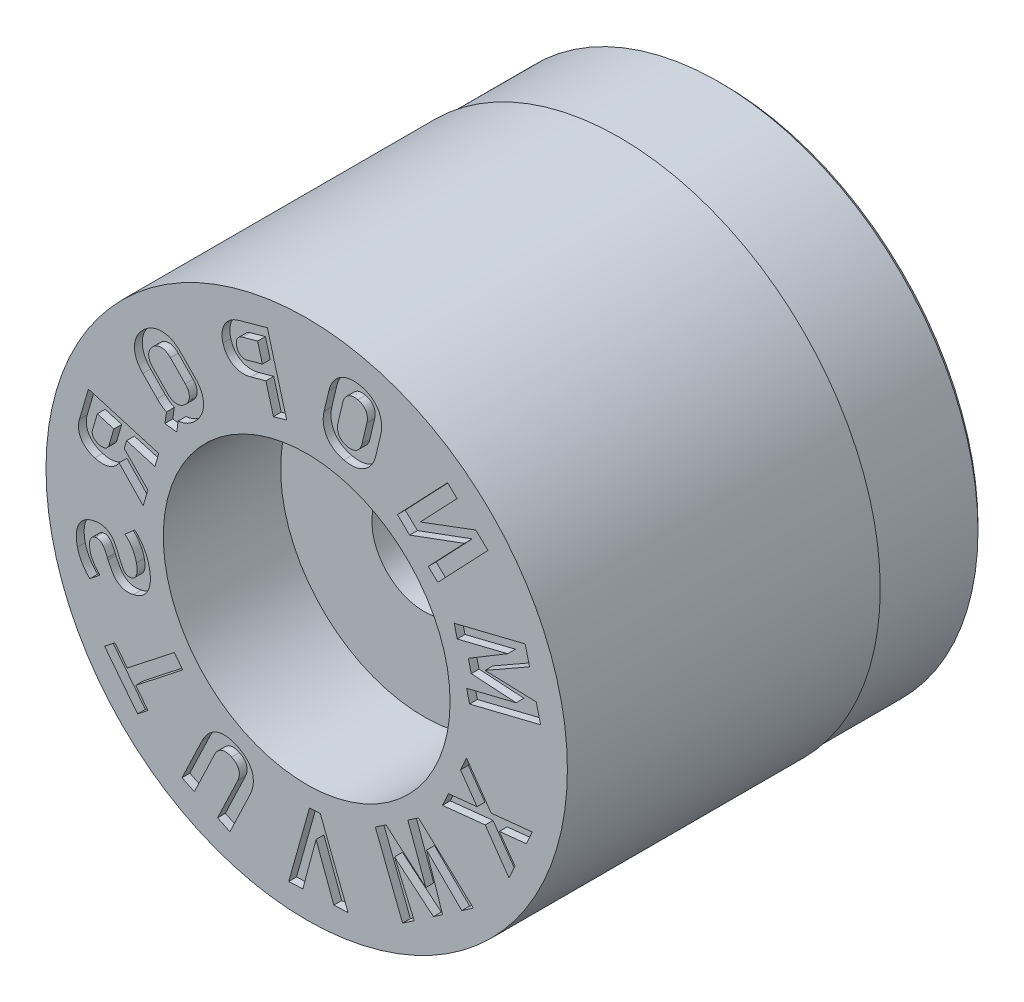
from build123d import *

# Parameters (mm, degrees)
SKETCH4_W          = 4
SKETCH4_H          = 1
CUT_EXTRUDE1_DEPTH = 0.3


with BuildPart() as part:
    # Sketch1 → Revolve1 (revolve)
    with BuildSketch(Plane(origin=(0, 0, 0), x_dir=(0, 0, -1), z_dir=(1, 0, 0)), mode=Mode.PRIVATE) as revolve1_sk:
        Polygon((0, 10), (0, 5.5), (4.5, 5.5), (4.5, 2), (16, 2), (16, 9.75), (15.75, 10), align=None)
    revolve(revolve1_sk.sketch.rotate(Axis((0, 0, 3.797909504), (0, 0, -1)), 90), axis=Axis((0, 0, 3.797909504), (0, 0, -1)))

    # Sketch4 → Cut-Revolve1 (revolve, cut)
    with BuildSketch(Plane(origin=(0, 0, 0), x_dir=(0, 0, -1), z_dir=(1, 0, 0)), mode=Mode.PRIVATE) as cut_revolve1_sk:
        with Locations((14, 10.435)):
            Rectangle(SKETCH4_W, SKETCH4_H)
    revolve(cut_revolve1_sk.sketch.rotate(Axis((0, 0, 0), (0, 0, -1)), 90), axis=Axis((0, 0, 0), (0, 0, -1)), mode=Mode.SUBTRACT)

    # Sketch6 → Cut-Extrude1 (cut)
    # profile 1 of 12: a face of its own
    with BuildSketch(Plane.XY):
        with BuildLine():
            add(Edge.make_bspline(
                [(-2.591195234, 8.623127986), (-2.67044475, 8.600402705), (-2.785185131, 8.557647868), (-2.920440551, 8.472797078), (-3.007776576, 8.399955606), (-3.083752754, 8.318885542), (-3.145008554, 8.228256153), (-3.193731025, 8.130741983), (-3.226912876, 8.025695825), (-3.246772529, 7.915324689), (-3.252473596, 7.758882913), (-3.232792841, 7.640639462), (-3.211239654, 7.562895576)],
                knots=[0, 0, 0, 0, 0.179252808, 0.26350448, 0.345433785, 0.425515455, 0.503835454, 0.58205309, 0.66132605, 0.742114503, 0.824797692, 1, 1, 1, 1], degree=3))
            add(Edge.make_bspline(
                [(-3.211239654, 7.562895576), (-3.189282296, 7.485519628), (-3.147361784, 7.37309945), (-3.061882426, 7.242258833), (-2.98904864, 7.157205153), (-2.90603578, 7.085495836), (-2.815405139, 7.025693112), (-2.715699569, 6.98117484), (-2.609214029, 6.949705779), (-2.496727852, 6.931710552), (-2.337213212, 6.929964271), (-2.216820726, 6.950005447), (-2.137298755, 6.972257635)],
                knots=[0, 0, 0, 0, 0.175255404, 0.258011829, 0.33862957, 0.417861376, 0.495706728, 0.573814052, 0.654275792, 0.736487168, 0.820589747, 1, 1, 1, 1], degree=3))
            Line((-2.137298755, 6.972257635), (-1.564446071, 7.129642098))
            Line((-1.564446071, 7.129642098), (-1.276887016, 6.083230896))
            Line((-1.276887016, 6.083230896), (-0.768489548, 6.223100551))
            Line((-0.768489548, 6.223100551), (-1.509652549, 8.920150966))
            Line((-1.509652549, 8.920150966), (-2.591195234, 8.623127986))
        make_face()
        with BuildLine():
            add(Edge.make_bspline(
                [(-2.284980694, 7.458077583), (-2.313807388, 7.450144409), (-2.357619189, 7.443387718), (-2.415615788, 7.446547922), (-2.456871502, 7.454494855), (-2.496460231, 7.46803516), (-2.533105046, 7.488267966), (-2.567328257, 7.513136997), (-2.598597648, 7.543483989), (-2.626623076, 7.578320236), (-2.659239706, 7.631792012), (-2.676053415, 7.676587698), (-2.684524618, 7.707690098)],
                knots=[0, 0, 0, 0, 0.169501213, 0.248727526, 0.328129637, 0.406936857, 0.484764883, 0.564451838, 0.646040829, 0.730951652, 0.817193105, 1, 1, 1, 1], degree=3))
            add(Edge.make_bspline(
                [(-2.684524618, 7.707690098), (-2.693901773, 7.739260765), (-2.701693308, 7.787033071), (-2.702242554, 7.850356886), (-2.696187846, 7.894778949), (-2.685212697, 7.936888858), (-2.669201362, 7.976086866), (-2.647300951, 8.011810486), (-2.620795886, 8.044201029), (-2.589625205, 8.072930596), (-2.540710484, 8.105531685), (-2.498612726, 8.121481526), (-2.469571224, 8.129768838)],
                knots=[0, 0, 0, 0, 0.184831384, 0.270674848, 0.355195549, 0.436120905, 0.51483931, 0.592349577, 0.670842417, 0.749502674, 0.829832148, 1, 1, 1, 1], degree=3))
            Line((-2.469571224, 8.129768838), (-1.883564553, 8.29089628))
            Line((-1.883564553, 8.29089628), (-1.698979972, 7.619203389))
            Line((-1.698979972, 7.619203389), (-2.284980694, 7.458077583))
        make_face(mode=Mode.SUBTRACT)
    # profile 2 of 12: a face of its own
    with BuildSketch(Plane.XY):
        with BuildLine():
            Line((-4.988295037, 3.71702284), (-4.92936312, 4.112455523))
            add(Edge.make_bspline(
                [(-4.92936312, 4.112455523), (-4.915193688, 4.113560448), (-4.879630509, 4.1172314), (-4.822934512, 4.127400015), (-4.759159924, 4.142119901), (-4.696055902, 4.161588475), (-4.634055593, 4.185879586), (-4.573475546, 4.214864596), (-4.513378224, 4.247465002), (-4.455349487, 4.285641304), (-4.377415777, 4.341591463), (-4.323512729, 4.390578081), (-4.287940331, 4.424416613)],
                knots=[0.553649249, 0.553649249, 0.553649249, 0.553649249, 0.579784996, 0.619379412, 0.659521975, 0.700129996, 0.740745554, 0.781900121, 0.82360875, 0.866408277, 0.909588, 1, 1, 1, 1], degree=3))
            add(Edge.make_bspline(
                [(-4.287940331, 4.424416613), (-4.252411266, 4.458519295), (-4.203348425, 4.51246366), (-4.144893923, 4.588514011), (-4.105417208, 4.64574899), (-4.071126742, 4.704777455), (-4.040591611, 4.764843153), (-4.015439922, 4.826429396), (-3.993704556, 4.888670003), (-3.976440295, 4.951696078), (-3.96508066, 5.015254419), (-3.956661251, 5.078658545), (-3.954221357, 5.142356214), (-3.955950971, 5.20610561), (-3.962435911, 5.269974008), (-3.973462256, 5.33375012), (-3.988983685, 5.397468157), (-4.009094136, 5.460731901), (-4.033713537, 5.523028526), (-4.063431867, 5.584042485), (-4.097115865, 5.644029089), (-4.135472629, 5.702989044), (-4.192510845, 5.781472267), (-4.241993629, 5.83631679), (-4.276283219, 5.872223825)],
                knots=[0, 0, 0, 0, 0.090541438, 0.133852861, 0.176352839, 0.218315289, 0.259314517, 0.30017771, 0.340558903, 0.380521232, 0.420203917, 0.45922422, 0.498060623, 0.537296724, 0.576434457, 0.616019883, 0.656243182, 0.69695486, 0.7380197, 0.779323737, 0.821679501, 0.864469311, 0.908620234, 1, 1, 1, 1], degree=3))
            Line((-4.276283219, 5.872223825), (-4.827791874, 6.437969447))
            add(Edge.make_bspline(
                [(-4.827791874, 6.437969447), (-4.862366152, 6.473558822), (-4.916268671, 6.523627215), (-4.99303839, 6.582969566), (-5.051097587, 6.622289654), (-5.10995445, 6.658041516), (-5.170306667, 6.688592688), (-5.23210631, 6.714658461), (-5.294780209, 6.73681774), (-5.358169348, 6.754613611), (-5.42189329, 6.766622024), (-5.485463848, 6.775622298), (-5.549156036, 6.778649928), (-5.612877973, 6.777387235), (-5.676621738, 6.771746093), (-5.740263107, 6.760334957), (-5.804035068, 6.745609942), (-5.8671492, 6.726159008), (-5.92911147, 6.701802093), (-5.989923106, 6.673025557), (-6.049454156, 6.639466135), (-6.108244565, 6.60228646), (-6.185367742, 6.545162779), (-6.239876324, 6.496838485), (-6.275271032, 6.462746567)],
                knots=[0, 0, 0, 0, 0.091249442, 0.135045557, 0.178318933, 0.22014303, 0.261604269, 0.302590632, 0.343407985, 0.383789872, 0.423525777, 0.462578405, 0.501768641, 0.540634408, 0.579726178, 0.619307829, 0.65943745, 0.700032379, 0.740634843, 0.781776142, 0.82364848, 0.866237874, 0.909617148, 1, 1, 1, 1], degree=3))
            add(Edge.make_bspline(
                [(-6.275271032, 6.462746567), (-6.310462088, 6.428536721), (-6.359978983, 6.375205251), (-6.418494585, 6.299150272), (-6.457444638, 6.241580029), (-6.492256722, 6.182874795), (-6.522576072, 6.122872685), (-6.5477649, 6.061308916), (-6.569490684, 5.999062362), (-6.586756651, 5.936037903), (-6.598118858, 5.872478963), (-6.606551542, 5.808886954), (-6.609009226, 5.745184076), (-6.607169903, 5.681448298), (-6.600956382, 5.617686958), (-6.588967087, 5.554042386), (-6.5736992, 5.490241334), (-6.553517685, 5.426989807), (-6.52891548, 5.364691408), (-6.499200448, 5.30367208), (-6.46548493, 5.243709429), (-6.427335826, 5.184783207), (-6.3697411, 5.106896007), (-6.320753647, 5.051873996), (-6.286329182, 5.016065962)],
                knots=[0, 0, 0, 0, 0.090315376, 0.133647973, 0.176462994, 0.218139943, 0.259159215, 0.300042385, 0.34044332, 0.380425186, 0.420127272, 0.459166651, 0.498371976, 0.537277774, 0.57643464, 0.616108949, 0.656351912, 0.697083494, 0.738168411, 0.77949264, 0.821869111, 0.864679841, 0.908575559, 1, 1, 1, 1], degree=3))
            Line((-6.286329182, 5.016065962), (-5.734820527, 4.450320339))
            add(Edge.make_bspline(
                [(-5.734820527, 4.450320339), (-5.700358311, 4.414592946), (-5.646045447, 4.36485089), (-5.569827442, 4.304903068), (-5.511916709, 4.265119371), (-5.452756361, 4.229858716), (-5.407084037, 4.206606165), (-5.381301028, 4.194931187), (-5.376038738, 4.192604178)],
                knots=[0, 0, 0, 0, 0.09127887, 0.135296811, 0.178290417, 0.220432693, 0.261907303, 0.272490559, 0.272490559, 0.272490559, 0.272490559], degree=3))
            Line((-5.376038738, 4.192604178), (-5.438853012, 3.777376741))
            Line((-5.438853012, 3.777376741), (-4.988295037, 3.71702284))
        make_face()
        with BuildLine():
            Line((-5.227483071, 6.067245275), (-4.657050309, 5.482190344))
            add(Edge.make_bspline(
                [(-4.657050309, 5.482190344), (-4.62442155, 5.44941543), (-4.582934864, 5.395558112), (-4.540001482, 5.317654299), (-4.518235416, 5.258149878), (-4.50473558, 5.197718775), (-4.499901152, 5.137270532), (-4.503506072, 5.077114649), (-4.516876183, 5.017773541), (-4.538017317, 4.959227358), (-4.58060022, 4.883376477), (-4.621817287, 4.831319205), (-4.654685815, 4.800605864)],
                knots=[0, 0, 0, 0, 0.180280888, 0.264139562, 0.346503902, 0.426870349, 0.505307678, 0.582632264, 0.661315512, 0.742137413, 0.824876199, 1, 1, 1, 1], degree=3))
            add(Edge.make_bspline(
                [(-4.654685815, 4.800605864), (-4.686733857, 4.769362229), (-4.738586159, 4.727597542), (-4.81613536, 4.688847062), (-4.874880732, 4.66909576), (-4.934635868, 4.657045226), (-4.995117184, 4.654802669), (-5.055593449, 4.660667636), (-5.115309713, 4.67647403), (-5.174272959, 4.699327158), (-5.251626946, 4.74335129), (-5.303568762, 4.787440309), (-5.335714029, 4.820488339)],
                knots=[0, 0, 0, 0, 0.175162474, 0.257631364, 0.337589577, 0.416766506, 0.494992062, 0.57327058, 0.653335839, 0.735643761, 0.819774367, 1, 1, 1, 1], degree=3))
            Line((-5.335714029, 4.820488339), (-5.906146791, 5.405543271))
            add(Edge.make_bspline(
                [(-5.906146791, 5.405543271), (-5.938656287, 5.438382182), (-5.980587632, 5.492187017), (-6.023038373, 5.570540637), (-6.044881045, 5.62997816), (-6.058466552, 5.690185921), (-6.063500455, 5.750490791), (-6.05888983, 5.810571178), (-6.045940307, 5.869813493), (-6.024458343, 5.927760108), (-5.982857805, 6.003769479), (-5.940356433, 6.054816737), (-5.907969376, 6.085972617)],
                knots=[0, 0, 0, 0, 0.180520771, 0.265137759, 0.347611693, 0.427363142, 0.505904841, 0.583364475, 0.66215242, 0.742377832, 0.824225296, 1, 1, 1, 1], degree=3))
            add(Edge.make_bspline(
                [(-5.907969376, 6.085972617), (-5.876015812, 6.117378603), (-5.823821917, 6.158734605), (-5.746541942, 6.198259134), (-5.687851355, 6.218756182), (-5.628171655, 6.23057853), (-5.567876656, 6.233006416), (-5.507709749, 6.226826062), (-5.447649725, 6.212179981), (-5.389071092, 6.188193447), (-5.311505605, 6.144559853), (-5.259662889, 6.100198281), (-5.227483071, 6.067245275)],
                knots=[0, 0, 0, 0, 0.175168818, 0.257991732, 0.338211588, 0.417391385, 0.494878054, 0.573159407, 0.653065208, 0.735634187, 0.81976784, 1, 1, 1, 1], degree=3))
        make_face(mode=Mode.SUBTRACT)
    # profile 3 of 12: a face of its own
    with BuildSketch(Plane.XY):
        with BuildLine():
            add(Edge.make_bspline(
                [(-8.718530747, 2.272305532), (-8.739406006, 2.20204696), (-8.758667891, 2.094830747), (-8.753785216, 1.952478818), (-8.736079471, 1.851296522), (-8.703413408, 1.755234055), (-8.659088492, 1.664478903), (-8.599926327, 1.581223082), (-8.528264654, 1.505143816), (-8.44534199, 1.43596101), (-8.315526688, 1.355822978), (-8.207258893, 1.311451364), (-8.130967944, 1.289828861)],
                knots=[0, 0, 0, 0, 0.170771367, 0.250982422, 0.330577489, 0.40900235, 0.486464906, 0.564914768, 0.645788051, 0.729220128, 0.815575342, 1, 1, 1, 1], degree=3))
            add(Edge.make_bspline(
                [(-8.130967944, 1.289828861), (-8.055068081, 1.267246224), (-7.940295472, 1.245134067), (-7.787940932, 1.243308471), (-7.680719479, 1.255886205), (-7.579153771, 1.281747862), (-7.484244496, 1.319945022), (-7.397555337, 1.372376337), (-7.318456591, 1.436352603), (-7.250012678, 1.510113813), (-7.21165165, 1.564598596), (-7.194876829, 1.592122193)],
                knots=[0, 0, 0, 0, 0.184423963, 0.270194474, 0.35389435, 0.43505401, 0.513570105, 0.591211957, 0.670062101, 0.749724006, 0.824733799, 0.824733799, 0.824733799, 0.824733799], degree=3))
            Line((-7.194876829, 1.592122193), (-6.272832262, 0.622166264))
            Line((-6.272832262, 0.622166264), (-6.092420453, 1.237829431))
            Line((-6.092420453, 1.237829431), (-6.998405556, 2.163204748))
            Line((-6.998405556, 2.163204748), (-6.907959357, 2.471516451))
            Line((-6.907959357, 2.471516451), (-5.8235573, 2.153299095))
            Line((-5.8235573, 2.153299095), (-5.674607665, 2.66170992))
            Line((-5.674607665, 2.66170992), (-8.372311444, 3.453350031))
            Line((-8.372311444, 3.453350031), (-8.718530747, 2.272305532))
        make_face()
        with BuildLine():
            add(Edge.make_bspline(
                [(-7.582992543, 1.983038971), (-7.589856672, 1.958220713), (-7.605857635, 1.923617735), (-7.63511738, 1.882564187), (-7.662085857, 1.85738881), (-7.691752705, 1.834985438), (-7.725236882, 1.818045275), (-7.761781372, 1.80537099), (-7.801091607, 1.797810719), (-7.842841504, 1.794784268), (-7.902426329, 1.79531085), (-7.947275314, 1.80572021), (-7.977375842, 1.812885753)],
                knots=[0, 0, 0, 0, 0.159908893, 0.23595126, 0.312748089, 0.388947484, 0.467051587, 0.545577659, 0.629446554, 0.715777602, 0.806283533, 1, 1, 1, 1], degree=3))
            add(Edge.make_bspline(
                [(-7.977375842, 1.812885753), (-8.007233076, 1.821450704), (-8.049712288, 1.838351), (-8.101283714, 1.868150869), (-8.134563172, 1.89362108), (-8.163296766, 1.92148516), (-8.187816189, 1.95125262), (-8.206527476, 1.983744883), (-8.219715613, 2.018313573), (-8.228517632, 2.054347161), (-8.230255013, 2.105484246), (-8.225649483, 2.144137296), (-8.217280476, 2.16928771)],
                knots=[0, 0, 0, 0, 0.192684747, 0.282498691, 0.368990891, 0.452129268, 0.530546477, 0.607654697, 0.68370684, 0.759694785, 0.836703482, 1, 1, 1, 1], degree=3))
            Line((-8.217280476, 2.16928771), (-8.031784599, 2.801302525))
            Line((-8.031784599, 2.801302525), (-7.397464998, 2.615161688))
            Line((-7.397464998, 2.615161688), (-7.582992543, 1.983038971))
        make_face(mode=Mode.SUBTRACT)
    # profile 4 of 12: a face of its own
    with BuildSketch(Plane.XY):
        with BuildLine():
            Line((0.85000125, 8.008025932), (0.667250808, 7.236892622))
            add(Edge.make_bspline(
                [(0.667250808, 7.236892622), (0.65523135, 7.18847351), (0.642947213, 7.115440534), (0.633622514, 7.018517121), (0.630459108, 6.948047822), (0.633062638, 6.878900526), (0.639671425, 6.811124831), (0.650507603, 6.744601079), (0.665381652, 6.679673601), (0.685204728, 6.616802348), (0.707768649, 6.55575686), (0.735762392, 6.497895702), (0.766944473, 6.442185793), (0.801709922, 6.388522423), (0.841857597, 6.338288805), (0.884367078, 6.289241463), (0.931956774, 6.244118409), (0.982352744, 6.201169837), (1.036432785, 6.162159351), (1.092965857, 6.125381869), (1.153525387, 6.093851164), (1.216125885, 6.063452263), (1.306026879, 6.029454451), (1.375812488, 6.007852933), (1.423957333, 5.996945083)],
                knots=[0, 0, 0, 0, 0.091392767, 0.135555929, 0.178469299, 0.220603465, 0.262298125, 0.303240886, 0.344092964, 0.384290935, 0.42402646, 0.463295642, 0.501981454, 0.541037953, 0.580347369, 0.619781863, 0.659929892, 0.700442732, 0.741087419, 0.782099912, 0.823957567, 0.86616382, 0.909605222, 1, 1, 1, 1], degree=3))
            add(Edge.make_bspline(
                [(1.423957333, 5.996945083), (1.471844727, 5.985259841), (1.543807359, 5.973136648), (1.639593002, 5.963221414), (1.709324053, 5.961609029), (1.777825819, 5.963183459), (1.844780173, 5.970853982), (1.910658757, 5.98169564), (1.975053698, 5.996936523), (2.037630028, 6.016843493), (2.097859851, 6.04042158), (2.155888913, 6.068154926), (2.211199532, 6.09986054), (2.264102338, 6.135926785), (2.314728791, 6.175450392), (2.362878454, 6.219125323), (2.408673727, 6.266404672), (2.450814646, 6.317914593), (2.490638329, 6.372251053), (2.526727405, 6.430096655), (2.5591937, 6.49120408), (2.588944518, 6.554959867), (2.624045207, 6.645704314), (2.644567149, 6.716747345), (2.655774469, 6.765414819)],
                knots=[0, 0, 0, 0, 0.09029555, 0.133687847, 0.176436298, 0.218102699, 0.259215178, 0.299881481, 0.340471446, 0.380424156, 0.420189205, 0.458974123, 0.498245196, 0.536962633, 0.576277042, 0.61591342, 0.656066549, 0.696844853, 0.737838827, 0.779516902, 0.821728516, 0.864647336, 0.908441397, 1, 1, 1, 1], degree=3))
            Line((2.655774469, 6.765414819), (2.838524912, 7.53654813))
            add(Edge.make_bspline(
                [(2.838524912, 7.53654813), (2.850080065, 7.584987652), (2.863411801, 7.657771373), (2.872868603, 7.75474671), (2.874970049, 7.825223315), (2.873393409, 7.894110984), (2.866819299, 7.961552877), (2.856081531, 8.027832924), (2.840928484, 8.092812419), (2.822007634, 8.15599525), (2.798319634, 8.216735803), (2.771307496, 8.275209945), (2.739289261, 8.33079785), (2.704643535, 8.384485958), (2.664889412, 8.434823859), (2.622399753, 8.483655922), (2.574885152, 8.528873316), (2.524256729, 8.571548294), (2.470926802, 8.611653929), (2.413535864, 8.64709046), (2.353606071, 8.68016248), (2.290140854, 8.709159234), (2.200850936, 8.745219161), (2.130108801, 8.764201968), (2.082327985, 8.77623894)],
                knots=[0, 0, 0, 0, 0.091283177, 0.135446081, 0.178504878, 0.220472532, 0.261685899, 0.302628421, 0.34348026, 0.383929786, 0.423430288, 0.462913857, 0.501889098, 0.540945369, 0.579939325, 0.619373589, 0.659521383, 0.700033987, 0.740736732, 0.781714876, 0.823582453, 0.866147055, 0.909556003, 1, 1, 1, 1], degree=3))
            add(Edge.make_bspline(
                [(2.082327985, 8.77623894), (2.034391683, 8.787043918), (1.962688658, 8.801429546), (1.866991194, 8.809534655), (1.797377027, 8.812259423), (1.729039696, 8.809202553), (1.661661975, 8.803293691), (1.595866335, 8.791469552), (1.531554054, 8.775667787), (1.468786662, 8.756746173), (1.408675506, 8.732107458), (1.350519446, 8.704937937), (1.295426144, 8.672661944), (1.242174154, 8.63745116), (1.191530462, 8.597854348), (1.143778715, 8.55356947), (1.098120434, 8.505982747), (1.055075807, 8.454929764), (1.015558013, 8.400532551), (0.979437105, 8.342942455), (0.947099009, 8.28197414), (0.917344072, 8.218224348), (0.882224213, 8.127523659), (0.861886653, 8.056474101), (0.85000125, 8.008025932)],
                knots=[0, 0, 0, 0, 0.090202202, 0.133729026, 0.176021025, 0.217861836, 0.259087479, 0.299967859, 0.340298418, 0.380508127, 0.420048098, 0.459328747, 0.4981232, 0.537017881, 0.576338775, 0.6158572, 0.656350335, 0.697214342, 0.738215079, 0.779552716, 0.821771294, 0.864697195, 0.90849848, 1, 1, 1, 1], degree=3))
        make_face()
        with BuildLine():
            Line((2.310452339, 7.675436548), (2.121497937, 6.878037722))
            add(Edge.make_bspline(
                [(2.121497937, 6.878037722), (2.111222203, 6.832884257), (2.088740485, 6.768143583), (2.044618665, 6.690472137), (2.006270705, 6.639746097), (1.962669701, 6.595623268), (1.9133517, 6.559933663), (1.860183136, 6.531046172), (1.802715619, 6.509969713), (1.741735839, 6.497326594), (1.654966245, 6.490660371), (1.588980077, 6.500786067), (1.545193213, 6.510270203)],
                knots=[0, 0, 0, 0, 0.180291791, 0.264850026, 0.346935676, 0.427278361, 0.505457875, 0.583130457, 0.662262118, 0.742891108, 0.824953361, 1, 1, 1, 1], degree=3))
            add(Edge.make_bspline(
                [(1.545193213, 6.510270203), (1.501053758, 6.519556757), (1.439026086, 6.543364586), (1.363432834, 6.586383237), (1.315201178, 6.625852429), (1.273480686, 6.670375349), (1.239103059, 6.720186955), (1.211649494, 6.774320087), (1.192539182, 6.833118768), (1.18100795, 6.895435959), (1.176172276, 6.984596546), (1.185444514, 7.052531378), (1.196342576, 7.097490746)],
                knots=[0, 0, 0, 0, 0.175121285, 0.257590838, 0.338018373, 0.417080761, 0.494722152, 0.573173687, 0.652869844, 0.734881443, 0.819587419, 1, 1, 1, 1], degree=3))
            Line((1.196342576, 7.097490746), (1.385296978, 7.894889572))
            add(Edge.make_bspline(
                [(1.385296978, 7.894889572), (1.395576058, 7.940038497), (1.418048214, 8.004792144), (1.46218485, 8.08244349), (1.500493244, 8.133223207), (1.544176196, 8.177091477), (1.592897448, 8.213442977), (1.646132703, 8.242096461), (1.703561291, 8.263225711), (1.764551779, 8.275854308), (1.851317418, 8.282525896), (1.917306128, 8.272396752), (1.961092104, 8.26291382)],
                knots=[0, 0, 0, 0, 0.180352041, 0.264938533, 0.347051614, 0.427421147, 0.505292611, 0.582991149, 0.662149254, 0.742805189, 0.824894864, 1, 1, 1, 1], degree=3))
            add(Edge.make_bspline(
                [(1.961092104, 8.26291382), (2.004850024, 8.252823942), (2.067907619, 8.231035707), (2.142709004, 8.18658858), (2.191169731, 8.147421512), (2.232535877, 8.102732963), (2.267882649, 8.053528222), (2.294316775, 7.998694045), (2.314424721, 7.940018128), (2.325733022, 7.87747), (2.330661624, 7.788346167), (2.321329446, 7.720387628), (2.310452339, 7.675436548)],
                knots=[0, 0, 0, 0, 0.175038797, 0.257499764, 0.337870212, 0.416876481, 0.494111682, 0.572950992, 0.653116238, 0.735069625, 0.819715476, 1, 1, 1, 1], degree=3))
        make_face(mode=Mode.SUBTRACT)
    # profile 5 of 12: a face of its own
    with BuildSketch(Plane.XY):
        Polygon((4.664945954, 4.080625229), (5.030049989, 3.733628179), (6.95354354, 5.755869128), (6.486532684, 6.199515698), (4.3575628, 5.40209621), (5.767090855, 6.883759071), (5.40315486, 7.230242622), (3.479661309, 5.208001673), (3.948494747, 4.762160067), (6.051865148, 5.539102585), align=None)
    # profile 6 of 12: a face of its own
    with BuildSketch(Plane.XY):
        Polygon((8.803601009, 1.648867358), (6.840692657, 1.713201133), (8.547570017, 2.685856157), (8.380351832, 3.362026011), (5.65789449, 2.688947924), (5.773188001, 2.222764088), (7.706533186, 2.700408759), (6.20084341, 1.795359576), (6.312544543, 1.342117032), (8.031249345, 1.2347604), (6.133068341, 0.765803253), (6.248361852, 0.299619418), (8.970819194, 0.972697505), align=None)
    # profile 7 of 12: a face of its own
    with BuildSketch(Plane.XY):
        Polygon((5.436502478, -3.081005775), (5.206882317, -3.586151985), (6.848035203, -3.41569667), (7.759106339, -4.719489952), (7.9887265, -4.214343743), (7.390181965, -3.359510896), (8.425217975, -3.252639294), (8.654838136, -2.747493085), (7.076678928, -2.910992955), (6.129787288, -1.554142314), (5.900167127, -2.059288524), (6.534798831, -2.967151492), align=None)
    # profile 8 of 12: a face of its own
    with BuildSketch(Plane.XY):
        Polygon((4.124924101, -7.957999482), (3.369784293, -6.216681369), (4.862154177, -7.453879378), (5.211381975, -7.215381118), (4.600186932, -5.375301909), (5.948819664, -6.71072951), (6.395942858, -6.405103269), (4.287812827, -4.462416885), (3.879048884, -4.74198255), (4.571298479, -6.633326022), (3.041498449, -5.314733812), (2.632734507, -5.594299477), (3.677800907, -8.263625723), align=None)
    # profile 9 of 12: a face of its own
    with BuildSketch(Plane.XY):
        Polygon((0.52086762, -6.201195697), (0.108305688, -6.220992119), (-0.690613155, -9.065359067), (-0.147382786, -9.039243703), (0.358505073, -7.143288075), (1.042429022, -8.982760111), (1.585714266, -8.957212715), align=None)
    # profile 10 of 12: a face of its own
    with BuildSketch(Plane.XY):
        with BuildLine():
            Line((-2.944967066, -8.539437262), (-2.180023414, -6.933911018))
            add(Edge.make_bspline(
                [(-2.180023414, -6.933911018), (-2.157512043, -6.886271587), (-2.127123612, -6.814605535), (-2.094660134, -6.717850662), (-2.076149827, -6.647383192), (-2.061215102, -6.578298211), (-2.051739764, -6.510013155), (-2.046694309, -6.442925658), (-2.046041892, -6.376904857), (-2.051059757, -6.312409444), (-2.058955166, -6.249252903), (-2.072738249, -6.187951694), (-2.090831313, -6.12825461), (-2.113654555, -6.070118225), (-2.141054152, -6.013727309), (-2.172852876, -5.958979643), (-2.209133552, -5.906135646), (-2.249804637, -5.855168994), (-2.294596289, -5.806014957), (-2.34437678, -5.759562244), (-2.398050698, -5.714986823), (-2.456026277, -5.672748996), (-2.540178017, -5.618319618), (-2.607380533, -5.581782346), (-2.654392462, -5.560044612)],
                knots=[0, 0, 0, 0, 0.095628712, 0.14111516, 0.185099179, 0.227799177, 0.269321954, 0.310104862, 0.349841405, 0.389010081, 0.427433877, 0.465257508, 0.502886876, 0.540552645, 0.578484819, 0.616567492, 0.655355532, 0.694710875, 0.734827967, 0.77593539, 0.818180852, 0.861387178, 0.906036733, 1, 1, 1, 1], degree=3))
            add(Edge.make_bspline(
                [(-2.654392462, -5.560044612), (-2.70131127, -5.538053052), (-2.771516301, -5.507763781), (-2.866807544, -5.476799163), (-2.935999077, -5.458524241), (-3.004317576, -5.444740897), (-3.071731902, -5.435934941), (-3.138026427, -5.432469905), (-3.203023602, -5.432702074), (-3.266861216, -5.437985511), (-3.329258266, -5.447333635), (-3.390002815, -5.462152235), (-3.449523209, -5.480315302), (-3.506986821, -5.504618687), (-3.563053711, -5.532913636), (-3.617324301, -5.565949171), (-3.669894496, -5.603455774), (-3.720745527, -5.645482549), (-3.769640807, -5.691722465), (-3.816471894, -5.742293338), (-3.86112132, -5.797011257), (-3.90402903, -5.855892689), (-3.958233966, -5.94226776), (-3.99547486, -6.010536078), (-4.017771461, -6.058230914)],
                knots=[0, 0, 0, 0, 0.094194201, 0.138674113, 0.181946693, 0.224161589, 0.265229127, 0.305355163, 0.344702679, 0.383238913, 0.421649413, 0.459212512, 0.496756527, 0.53459368, 0.572418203, 0.610786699, 0.649915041, 0.689661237, 0.730561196, 0.772105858, 0.814807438, 0.858820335, 0.904394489, 1, 1, 1, 1], degree=3))
            Line((-4.017771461, -6.058230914), (-4.782715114, -7.663757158))
            Line((-4.782715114, -7.663757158), (-4.308174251, -7.889533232))
            Line((-4.308174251, -7.889533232), (-3.537513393, -6.272029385))
            add(Edge.make_bspline(
                [(-3.537513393, -6.272029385), (-3.521675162, -6.237672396), (-3.493853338, -6.189722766), (-3.45127477, -6.131529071), (-3.417775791, -6.093935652), (-3.381920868, -6.061386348), (-3.34453538, -6.032662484), (-3.304137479, -6.010014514), (-3.262291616, -5.991203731), (-3.218402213, -5.978186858), (-3.173281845, -5.969071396), (-3.126588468, -5.966690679), (-3.078945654, -5.968185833), (-3.030052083, -5.975488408), (-2.961891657, -5.993149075), (-2.911071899, -6.011989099), (-2.87789085, -6.028332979)],
                knots=[0, 0, 0, 0, 0.141855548, 0.207485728, 0.270399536, 0.330478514, 0.389062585, 0.446928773, 0.503911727, 0.560921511, 0.618416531, 0.676265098, 0.735973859, 0.797112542, 0.861369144, 1, 1, 1, 1], degree=3))
            add(Edge.make_bspline(
                [(-2.87789085, -6.028332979), (-2.844335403, -6.044306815), (-2.796564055, -6.070910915), (-2.739747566, -6.113586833), (-2.702630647, -6.146940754), (-2.671357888, -6.183417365), (-2.643647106, -6.221387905), (-2.621979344, -6.26232877), (-2.604116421, -6.304914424), (-2.591852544, -6.349327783), (-2.584330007, -6.395250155), (-2.581929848, -6.442456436), (-2.585359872, -6.490904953), (-2.592602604, -6.540612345), (-2.611917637, -6.610071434), (-2.631579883, -6.661819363), (-2.648403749, -6.695798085)],
                knots=[0, 0, 0, 0, 0.138953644, 0.203422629, 0.265239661, 0.324978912, 0.382657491, 0.440506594, 0.497621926, 0.554922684, 0.612223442, 0.671218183, 0.731075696, 0.793466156, 0.858574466, 1, 1, 1, 1], degree=3))
            Line((-2.648403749, -6.695798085), (-3.419064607, -8.313301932))
            Line((-3.419064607, -8.313301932), (-2.944967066, -8.539437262))
        make_face()
    # profile 11 of 12: a face of its own
    with BuildSketch(Plane.XY):
        Polygon((-6.883262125, -5.067585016), (-7.35417437, -4.466946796), (-7.753812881, -4.780674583), (-6.487206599, -6.396203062), (-6.087568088, -6.082475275), (-6.558018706, -5.482425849), (-4.754264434, -4.067898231), (-5.079541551, -3.653083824), align=None)
    # profile 12 of 12: a face of its own
    with BuildSketch(Plane.XY):
        with BuildLine():
            Line((-6.642454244, -2.510631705), (-6.638867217, -2.510235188))
            add(Edge.make_bspline(
                [(-6.638867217, -2.510235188), (-6.597062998, -2.50056869), (-6.535646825, -2.484235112), (-6.458240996, -2.453311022), (-6.40380148, -2.428250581), (-6.353395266, -2.397985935), (-6.305098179, -2.366241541), (-6.260422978, -2.330442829), (-6.219335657, -2.291251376), (-6.181385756, -2.249187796), (-6.14666975, -2.204386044), (-6.115785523, -2.156477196), (-6.087812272, -2.106040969), (-6.064432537, -2.05207017), (-6.043808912, -1.995586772), (-6.02731708, -1.936042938), (-6.01369288, -1.873942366), (-6.004255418, -1.809147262), (-5.997703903, -1.742027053), (-5.996337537, -1.67252411), (-5.996972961, -1.60081971), (-6.002325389, -1.52679545), (-6.014328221, -1.423325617), (-6.028384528, -1.344983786), (-6.039704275, -1.292294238)],
                knots=[0, 0, 0, 0, 0.083813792, 0.123589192, 0.162561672, 0.200600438, 0.238187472, 0.275274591, 0.312128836, 0.348874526, 0.38572877, 0.422592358, 0.460004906, 0.498132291, 0.537237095, 0.577252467, 0.618598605, 0.661216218, 0.7049505, 0.750098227, 0.796789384, 0.844834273, 0.894833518, 1, 1, 1, 1], degree=3))
            add(Edge.make_bspline(
                [(-6.039704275, -1.292294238), (-6.054084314, -1.227941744), (-6.079295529, -1.132398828), (-6.124790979, -1.00932863), (-6.162173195, -0.919430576), (-6.20409177, -0.832618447), (-6.24997015, -0.749301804), (-6.299868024, -0.669726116), (-6.353386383, -0.59405644), (-6.410681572, -0.523191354), (-6.489740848, -0.435488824), (-6.555468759, -0.377195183), (-6.601022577, -0.341515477)],
                knots=[0, 0, 0, 0, 0.175837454, 0.262821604, 0.349569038, 0.435262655, 0.519641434, 0.602962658, 0.685493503, 0.766525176, 0.84573467, 1, 1, 1, 1], degree=3))
            Line((-6.601022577, -0.341515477), (-6.972282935, -0.671571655))
            add(Edge.make_bspline(
                [(-6.972282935, -0.671571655), (-6.917534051, -0.715189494), (-6.840554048, -0.788312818), (-6.752708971, -0.90037234), (-6.691872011, -0.991182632), (-6.638697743, -1.087763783), (-6.578669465, -1.222183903), (-6.54514744, -1.327430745), (-6.530000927, -1.399503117)],
                knots=[0, 0, 0, 0, 0.242001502, 0.365112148, 0.491583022, 0.619467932, 0.745713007, 1, 1, 1, 1], degree=3))
            add(Edge.make_bspline(
                [(-6.530000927, -1.399503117), (-6.521873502, -1.439004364), (-6.510608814, -1.497078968), (-6.504567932, -1.573305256), (-6.501468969, -1.625867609), (-6.50461205, -1.675500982), (-6.508622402, -1.722406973), (-6.517769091, -1.76622618), (-6.529486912, -1.807084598), (-6.545043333, -1.844462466), (-6.563493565, -1.878343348), (-6.584830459, -1.908593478), (-6.609712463, -1.934876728), (-6.638151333, -1.956529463), (-6.680581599, -1.98133122), (-6.716020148, -1.993588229), (-6.740803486, -1.998659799)],
                knots=[0, 0, 0, 0, 0.170344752, 0.248767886, 0.322524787, 0.39214622, 0.458335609, 0.520925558, 0.580630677, 0.637412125, 0.691332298, 0.743083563, 0.793146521, 0.843363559, 0.893342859, 1, 1, 1, 1], degree=3))
            Line((-6.740803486, -1.998659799), (-6.743115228, -1.999096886))
            add(Edge.make_bspline(
                [(-6.743115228, -1.999096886), (-6.775868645, -2.00734629), (-6.825445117, -2.010106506), (-6.888599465, -1.996987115), (-6.929684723, -1.976290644), (-6.966466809, -1.948856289), (-7.000764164, -1.916456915), (-7.030800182, -1.877494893), (-7.058767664, -1.833154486), (-7.084710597, -1.782293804), (-7.122462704, -1.701836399), (-7.149933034, -1.637388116), (-7.167762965, -1.591636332)],
                knots=[0, 0, 0, 0, 0.154872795, 0.225481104, 0.294573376, 0.364767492, 0.436341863, 0.51113011, 0.590666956, 0.677500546, 0.773863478, 1, 1, 1, 1], degree=3))
            add(Edge.make_bspline(
                [(-7.167762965, -1.591636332), (-7.169580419, -1.588465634), (-7.171801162, -1.581755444), (-7.173725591, -1.574951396), (-7.175563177, -1.571984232)],
                knots=[0, 0, 0, 0, 0.513378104, 1, 1, 1, 1], degree=3))
            Line((-7.175563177, -1.571984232), (-7.190127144, -1.532202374))
            add(Edge.make_bspline(
                [(-7.190127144, -1.532202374), (-7.222311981, -1.451490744), (-7.269915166, -1.335791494), (-7.343631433, -1.194612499), (-7.39469714, -1.103315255), (-7.453115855, -1.02312299), (-7.521252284, -0.952982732), (-7.601322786, -0.893620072), (-7.675404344, -0.852202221), (-7.739853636, -0.824867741), (-7.792648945, -0.810325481), (-7.848436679, -0.79931272), (-7.90787736, -0.794258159), (-7.970523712, -0.793374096), (-8.061171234, -0.800392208), (-8.130478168, -0.810709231), (-8.177294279, -0.821659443)],
                knots=[0, 0, 0, 0, 0.190688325, 0.27376957, 0.349175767, 0.419846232, 0.490685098, 0.562715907, 0.637626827, 0.676288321, 0.715916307, 0.75746635, 0.800817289, 0.846523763, 0.894703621, 1, 1, 1, 1], degree=3))
            Line((-8.177294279, -0.821659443), (-8.17960602, -0.82209653))
            add(Edge.make_bspline(
                [(-8.17960602, -0.82209653), (-8.222053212, -0.831017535), (-8.283925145, -0.848464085), (-8.362629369, -0.878780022), (-8.417826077, -0.903906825), (-8.46932751, -0.932895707), (-8.518025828, -0.964555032), (-8.563189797, -0.999975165), (-8.605404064, -1.038279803), (-8.644286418, -1.079388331), (-8.679520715, -1.123341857), (-8.710986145, -1.170165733), (-8.739152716, -1.219721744), (-8.76397912, -1.271786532), (-8.78513515, -1.326678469), (-8.802115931, -1.384292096), (-8.816989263, -1.444289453), (-8.826741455, -1.507209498), (-8.833711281, -1.572158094), (-8.837143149, -1.639602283), (-8.835054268, -1.70905594), (-8.831515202, -1.780997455), (-8.819567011, -1.881432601), (-8.806272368, -1.957480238), (-8.795131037, -2.008623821)],
                knots=[0, 0, 0, 0, 0.085786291, 0.126885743, 0.166771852, 0.205645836, 0.243695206, 0.281573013, 0.319060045, 0.35637293, 0.393394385, 0.430371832, 0.467858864, 0.506064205, 0.544382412, 0.584099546, 0.624825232, 0.666570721, 0.709936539, 0.754030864, 0.800031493, 0.847337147, 0.896480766, 1, 1, 1, 1], degree=3))
            add(Edge.make_bspline(
                [(-8.795131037, -2.008623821), (-8.783434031, -2.05768914), (-8.764000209, -2.13179883), (-8.727313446, -2.227764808), (-8.686236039, -2.325196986), (-8.623701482, -2.443567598), (-8.505984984, -2.624596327), (-8.39857709, -2.747231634), (-8.319021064, -2.820864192)],
                knots=[0, 0, 0, 0, 0.158577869, 0.240052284, 0.322536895, 0.490632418, 0.659706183, 1, 1, 1, 1], degree=3))
            Line((-8.319021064, -2.820864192), (-7.931988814, -2.508671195))
            add(Edge.make_bspline(
                [(-7.931988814, -2.508671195), (-7.978780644, -2.464942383), (-8.044381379, -2.3953305), (-8.122073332, -2.295203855), (-8.173269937, -2.217755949), (-8.21783627, -2.13899162), (-8.266835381, -2.035546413), (-8.292221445, -1.954899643), (-8.304316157, -1.901176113)],
                knots=[0, 0, 0, 0, 0.265737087, 0.396140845, 0.525534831, 0.650678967, 0.771457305, 1, 1, 1, 1], degree=3))
            add(Edge.make_bspline(
                [(-8.304316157, -1.901176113), (-8.312730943, -1.864108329), (-8.32201925, -1.809402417), (-8.329993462, -1.737915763), (-8.3305132, -1.688631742), (-8.330650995, -1.642249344), (-8.325799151, -1.598550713), (-8.318864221, -1.557476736), (-8.307634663, -1.519668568), (-8.294433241, -1.484690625), (-8.276953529, -1.453756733), (-8.258088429, -1.425421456), (-8.234990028, -1.401817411), (-8.209834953, -1.381033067), (-8.171258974, -1.358574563), (-8.139538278, -1.346543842), (-8.117009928, -1.34237769)],
                knots=[0, 0, 0, 0, 0.172931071, 0.252630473, 0.327115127, 0.397227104, 0.46361927, 0.527047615, 0.586603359, 0.642956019, 0.69682495, 0.748068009, 0.797440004, 0.846591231, 0.896228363, 1, 1, 1, 1], degree=3))
            Line((-8.117009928, -1.34237769), (-8.115216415, -1.342179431))
            add(Edge.make_bspline(
                [(-8.115216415, -1.342179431), (-8.079511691, -1.334898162), (-8.025601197, -1.329204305), (-7.957744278, -1.345427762), (-7.913684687, -1.36729728), (-7.874334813, -1.39676884), (-7.83751605, -1.430390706), (-7.805339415, -1.469782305), (-7.775613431, -1.514609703), (-7.747926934, -1.567456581), (-7.702646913, -1.654390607), (-7.671526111, -1.726663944), (-7.648818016, -1.77752097)],
                knots=[0, 0, 0, 0, 0.156601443, 0.22596926, 0.295213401, 0.365012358, 0.435282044, 0.5075683, 0.581527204, 0.664546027, 0.762070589, 1, 1, 1, 1], degree=3))
            add(Edge.make_bspline(
                [(-7.648818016, -1.77752097), (-7.646337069, -1.782055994), (-7.642923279, -1.791764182), (-7.639368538, -1.801421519), (-7.636957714, -1.805982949)],
                knots=[0, 0, 0, 0, 0.500025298, 1, 1, 1, 1], degree=3))
            add(Edge.make_bspline(
                [(-7.636957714, -1.805982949), (-7.633525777, -1.812772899), (-7.628096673, -1.827057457), (-7.61988208, -1.839994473), (-7.617851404, -1.847441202)],
                knots=[0, 0, 0, 0, 0.49968789, 1, 1, 1, 1], degree=3))
            add(Edge.make_bspline(
                [(-7.617851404, -1.847441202), (-7.585110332, -1.923679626), (-7.533354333, -2.031615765), (-7.458554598, -2.165245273), (-7.403168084, -2.250856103), (-7.343051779, -2.326998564), (-7.272740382, -2.391606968), (-7.193797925, -2.447385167), (-7.120643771, -2.485119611), (-7.057371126, -2.509475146), (-7.006313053, -2.522812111), (-6.952502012, -2.532440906), (-6.895805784, -2.536681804), (-6.836259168, -2.537095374), (-6.751053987, -2.531113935), (-6.686194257, -2.520504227), (-6.642454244, -2.510631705)],
                knots=[0, 0, 0, 0, 0.189282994, 0.272896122, 0.349247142, 0.421768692, 0.493576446, 0.566300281, 0.64174057, 0.680714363, 0.720777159, 0.761948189, 0.80528112, 0.850323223, 0.897714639, 1, 1, 1, 1], degree=3))
        make_face()
    extrude(amount=-CUT_EXTRUDE1_DEPTH, mode=Mode.SUBTRACT)


solid = part.part
